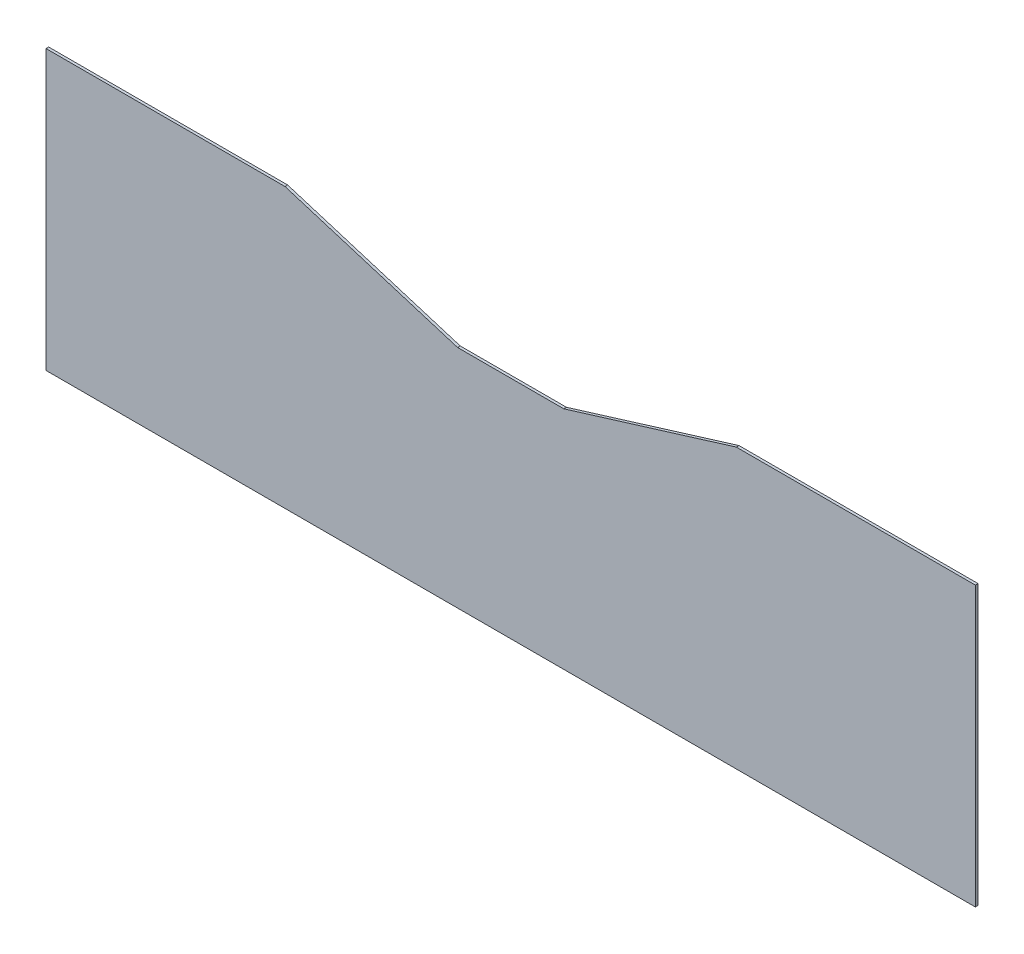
ISO-10303-21;
HEADER;
FILE_DESCRIPTION(('STEP AP214'),'2;1');
FILE_NAME('part.step','',(''),(''),'','','');
FILE_SCHEMA(('AUTOMOTIVE_DESIGN { 1 0 10303 214 1 1 1 1 }'));
ENDSEC;
DATA;
#1=APPLICATION_CONTEXT('core data for automotive mechanical design processes');
#2=APPLICATION_PROTOCOL_DEFINITION('international standard','automotive_design',2000,#1);
#3=PRODUCT_CONTEXT('',#1,'mechanical');
#4=PRODUCT('Part','Part','',(#3));
#5=PRODUCT_RELATED_PRODUCT_CATEGORY('part','',(#4));
#6=PRODUCT_DEFINITION_FORMATION('','',#4);
#7=PRODUCT_DEFINITION_CONTEXT('part definition',#1,'design');
#8=PRODUCT_DEFINITION('design','',#6,#7);
#9=PRODUCT_DEFINITION_SHAPE('','',#8);
#10=(LENGTH_UNIT() NAMED_UNIT(*) SI_UNIT(.MILLI.,.METRE.));
#11=(NAMED_UNIT(*) PLANE_ANGLE_UNIT() SI_UNIT($,.RADIAN.));
#12=(NAMED_UNIT(*) SI_UNIT($,.STERADIAN.) SOLID_ANGLE_UNIT());
#13=UNCERTAINTY_MEASURE_WITH_UNIT(LENGTH_MEASURE(1.E-05),#10,'distance_accuracy_value','');
#14=(GEOMETRIC_REPRESENTATION_CONTEXT(3) GLOBAL_UNCERTAINTY_ASSIGNED_CONTEXT((#13)) GLOBAL_UNIT_ASSIGNED_CONTEXT((#10,
#11,#12)) REPRESENTATION_CONTEXT('',''));
#15=CARTESIAN_POINT('',(0.,0.,0.));
#16=DIRECTION('',(0.,0.,1.));
#17=DIRECTION('',(1.,0.,0.));
#18=AXIS2_PLACEMENT_3D('',#15,#16,#17);
#19=CARTESIAN_POINT('',(0.,210.,2.));
#20=DIRECTION('',(1.,0.,0.));
#21=DIRECTION('',(0.,1.,0.));
#22=AXIS2_PLACEMENT_3D('',#19,#20,#21);
#23=PLANE('',#22);
#24=DIRECTION('',(0.,-1.,0.));
#25=VECTOR('',#24,1.);
#26=CARTESIAN_POINT('',(0.,210.,0.));
#27=LINE('',#26,#25);
#28=CARTESIAN_POINT('',(0.,210.,0.));
#29=VERTEX_POINT('',#28);
#30=CARTESIAN_POINT('',(0.,0.,0.));
#31=VERTEX_POINT('',#30);
#32=EDGE_CURVE('E130',#29,#31,#27,.T.);
#33=ORIENTED_EDGE('',*,*,#32,.T.);
#34=DIRECTION('',(0.,0.,-1.));
#35=VECTOR('',#34,1.);
#36=CARTESIAN_POINT('',(0.,0.,2.));
#37=LINE('',#36,#35);
#38=CARTESIAN_POINT('',(0.,0.,2.));
#39=VERTEX_POINT('',#38);
#40=EDGE_CURVE('E11',#39,#31,#37,.T.);
#41=ORIENTED_EDGE('',*,*,#40,.F.);
#42=DIRECTION('',(0.,-1.,0.));
#43=VECTOR('',#42,1.);
#44=CARTESIAN_POINT('',(0.,210.,2.));
#45=LINE('',#44,#43);
#46=CARTESIAN_POINT('',(0.,210.,2.));
#47=VERTEX_POINT('',#46);
#48=EDGE_CURVE('E144',#47,#39,#45,.T.);
#49=ORIENTED_EDGE('',*,*,#48,.F.);
#50=DIRECTION('',(0.,0.,-1.));
#51=VECTOR('',#50,1.);
#52=CARTESIAN_POINT('',(0.,210.,2.));
#53=LINE('',#52,#51);
#54=EDGE_CURVE('E126',#47,#29,#53,.T.);
#55=ORIENTED_EDGE('',*,*,#54,.T.);
#56=EDGE_LOOP('',(#33,#41,#49,#55));
#57=FACE_BOUND('',#56,.T.);
#58=ADVANCED_FACE('F34',(#57),#23,.F.);
#59=CARTESIAN_POINT('',(0.,0.,2.));
#60=DIRECTION('',(0.,1.,0.));
#61=DIRECTION('',(-1.,0.,0.));
#62=AXIS2_PLACEMENT_3D('',#59,#60,#61);
#63=PLANE('',#62);
#64=DIRECTION('',(1.,0.,0.));
#65=VECTOR('',#64,1.);
#66=CARTESIAN_POINT('',(0.,0.,0.));
#67=LINE('',#66,#65);
#68=CARTESIAN_POINT('',(700.,0.,0.));
#69=VERTEX_POINT('',#68);
#70=EDGE_CURVE('E133',#31,#69,#67,.T.);
#71=ORIENTED_EDGE('',*,*,#70,.T.);
#72=DIRECTION('',(0.,0.,-1.));
#73=VECTOR('',#72,1.);
#74=CARTESIAN_POINT('',(700.,0.,2.));
#75=LINE('',#74,#73);
#76=CARTESIAN_POINT('',(700.,0.,2.));
#77=VERTEX_POINT('',#76);
#78=EDGE_CURVE('E42',#77,#69,#75,.T.);
#79=ORIENTED_EDGE('',*,*,#78,.F.);
#80=DIRECTION('',(1.,0.,0.));
#81=VECTOR('',#80,1.);
#82=CARTESIAN_POINT('',(0.,0.,2.));
#83=LINE('',#82,#81);
#84=EDGE_CURVE('E93',#39,#77,#83,.T.);
#85=ORIENTED_EDGE('',*,*,#84,.F.);
#86=ORIENTED_EDGE('',*,*,#40,.T.);
#87=EDGE_LOOP('',(#71,#79,#85,#86));
#88=FACE_BOUND('',#87,.T.);
#89=ADVANCED_FACE('F179',(#88),#63,.F.);
#90=CARTESIAN_POINT('',(700.,0.,2.));
#91=DIRECTION('',(-1.,0.,0.));
#92=DIRECTION('',(0.,0.,1.));
#93=AXIS2_PLACEMENT_3D('',#90,#91,#92);
#94=PLANE('',#93);
#95=DIRECTION('',(0.,1.,0.));
#96=VECTOR('',#95,1.);
#97=CARTESIAN_POINT('',(700.,0.,0.));
#98=LINE('',#97,#96);
#99=CARTESIAN_POINT('',(700.,210.,0.));
#100=VERTEX_POINT('',#99);
#101=EDGE_CURVE('E135',#69,#100,#98,.T.);
#102=ORIENTED_EDGE('',*,*,#101,.T.);
#103=DIRECTION('',(0.,0.,-1.));
#104=VECTOR('',#103,1.);
#105=CARTESIAN_POINT('',(700.,210.,2.));
#106=LINE('',#105,#104);
#107=CARTESIAN_POINT('',(700.,210.,2.));
#108=VERTEX_POINT('',#107);
#109=EDGE_CURVE('E151',#108,#100,#106,.T.);
#110=ORIENTED_EDGE('',*,*,#109,.F.);
#111=DIRECTION('',(0.,1.,0.));
#112=VECTOR('',#111,1.);
#113=CARTESIAN_POINT('',(700.,0.,2.));
#114=LINE('',#113,#112);
#115=EDGE_CURVE('E159',#77,#108,#114,.T.);
#116=ORIENTED_EDGE('',*,*,#115,.F.);
#117=ORIENTED_EDGE('',*,*,#78,.T.);
#118=EDGE_LOOP('',(#102,#110,#116,#117));
#119=FACE_BOUND('',#118,.T.);
#120=ADVANCED_FACE('F157',(#119),#94,.F.);
#121=CARTESIAN_POINT('',(700.,210.,2.));
#122=DIRECTION('',(0.,-1.,0.));
#123=DIRECTION('',(1.,0.,0.));
#124=AXIS2_PLACEMENT_3D('',#121,#122,#123);
#125=PLANE('',#124);
#126=DIRECTION('',(-1.,0.,0.));
#127=VECTOR('',#126,1.);
#128=CARTESIAN_POINT('',(700.,210.,0.));
#129=LINE('',#128,#127);
#130=CARTESIAN_POINT('',(520.,210.,0.));
#131=VERTEX_POINT('',#130);
#132=EDGE_CURVE('E137',#100,#131,#129,.T.);
#133=ORIENTED_EDGE('',*,*,#132,.T.);
#134=DIRECTION('',(0.,0.,-1.));
#135=VECTOR('',#134,1.);
#136=CARTESIAN_POINT('',(520.,210.,2.));
#137=LINE('',#136,#135);
#138=CARTESIAN_POINT('',(520.,210.,2.));
#139=VERTEX_POINT('',#138);
#140=EDGE_CURVE('E148',#139,#131,#137,.T.);
#141=ORIENTED_EDGE('',*,*,#140,.F.);
#142=DIRECTION('',(-1.,0.,0.));
#143=VECTOR('',#142,1.);
#144=CARTESIAN_POINT('',(700.,210.,2.));
#145=LINE('',#144,#143);
#146=EDGE_CURVE('E171',#108,#139,#145,.T.);
#147=ORIENTED_EDGE('',*,*,#146,.F.);
#148=ORIENTED_EDGE('',*,*,#109,.T.);
#149=EDGE_LOOP('',(#133,#141,#147,#148));
#150=FACE_BOUND('',#149,.T.);
#151=ADVANCED_FACE('F167',(#150),#125,.F.);
#152=CARTESIAN_POINT('',(520.,210.,2.));
#153=DIRECTION('',(0.294085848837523,-0.95577900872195,0.));
#154=DIRECTION('',(0.95577900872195,0.294085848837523,0.));
#155=AXIS2_PLACEMENT_3D('',#152,#153,#154);
#156=PLANE('',#155);
#157=DIRECTION('',(-0.95577900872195,-0.294085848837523,0.));
#158=VECTOR('',#157,1.);
#159=CARTESIAN_POINT('',(520.,210.,0.));
#160=LINE('',#159,#158);
#161=CARTESIAN_POINT('',(390.,170.,0.));
#162=VERTEX_POINT('',#161);
#163=EDGE_CURVE('E139',#131,#162,#160,.T.);
#164=ORIENTED_EDGE('',*,*,#163,.T.);
#165=DIRECTION('',(0.,0.,-1.));
#166=VECTOR('',#165,1.);
#167=CARTESIAN_POINT('',(390.,170.,2.));
#168=LINE('',#167,#166);
#169=CARTESIAN_POINT('',(390.,170.,2.));
#170=VERTEX_POINT('',#169);
#171=EDGE_CURVE('E121',#170,#162,#168,.T.);
#172=ORIENTED_EDGE('',*,*,#171,.F.);
#173=DIRECTION('',(-0.95577900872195,-0.294085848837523,0.));
#174=VECTOR('',#173,1.);
#175=CARTESIAN_POINT('',(520.,210.,2.));
#176=LINE('',#175,#174);
#177=EDGE_CURVE('E112',#139,#170,#176,.T.);
#178=ORIENTED_EDGE('',*,*,#177,.F.);
#179=ORIENTED_EDGE('',*,*,#140,.T.);
#180=EDGE_LOOP('',(#164,#172,#178,#179));
#181=FACE_BOUND('',#180,.T.);
#182=ADVANCED_FACE('F170',(#181),#156,.F.);
#183=CARTESIAN_POINT('',(390.,170.,2.));
#184=DIRECTION('',(0.,-1.,0.));
#185=DIRECTION('',(0.,0.,-1.));
#186=AXIS2_PLACEMENT_3D('',#183,#184,#185);
#187=PLANE('',#186);
#188=DIRECTION('',(-1.,0.,0.));
#189=VECTOR('',#188,1.);
#190=CARTESIAN_POINT('',(390.,170.,0.));
#191=LINE('',#190,#189);
#192=CARTESIAN_POINT('',(310.,170.,0.));
#193=VERTEX_POINT('',#192);
#194=EDGE_CURVE('E120',#162,#193,#191,.T.);
#195=ORIENTED_EDGE('',*,*,#194,.T.);
#196=DIRECTION('',(0.,0.,-1.));
#197=VECTOR('',#196,1.);
#198=CARTESIAN_POINT('',(310.,170.,2.));
#199=LINE('',#198,#197);
#200=CARTESIAN_POINT('',(310.,170.,2.));
#201=VERTEX_POINT('',#200);
#202=EDGE_CURVE('E117',#201,#193,#199,.T.);
#203=ORIENTED_EDGE('',*,*,#202,.F.);
#204=DIRECTION('',(-1.,0.,0.));
#205=VECTOR('',#204,1.);
#206=CARTESIAN_POINT('',(390.,170.,2.));
#207=LINE('',#206,#205);
#208=EDGE_CURVE('E106',#170,#201,#207,.T.);
#209=ORIENTED_EDGE('',*,*,#208,.F.);
#210=ORIENTED_EDGE('',*,*,#171,.T.);
#211=EDGE_LOOP('',(#195,#203,#209,#210));
#212=FACE_BOUND('',#211,.T.);
#213=ADVANCED_FACE('F118',(#212),#187,.F.);
#214=CARTESIAN_POINT('',(310.,170.,2.));
#215=DIRECTION('',(-0.294085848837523,-0.95577900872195,0.));
#216=DIRECTION('',(0.95577900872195,-0.294085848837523,0.));
#217=AXIS2_PLACEMENT_3D('',#214,#215,#216);
#218=PLANE('',#217);
#219=DIRECTION('',(-0.95577900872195,0.294085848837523,0.));
#220=VECTOR('',#219,1.);
#221=CARTESIAN_POINT('',(310.,170.,0.));
#222=LINE('',#221,#220);
#223=CARTESIAN_POINT('',(180.,210.,0.));
#224=VERTEX_POINT('',#223);
#225=EDGE_CURVE('E79',#193,#224,#222,.T.);
#226=ORIENTED_EDGE('',*,*,#225,.T.);
#227=DIRECTION('',(0.,0.,-1.));
#228=VECTOR('',#227,1.);
#229=CARTESIAN_POINT('',(180.,210.,2.));
#230=LINE('',#229,#228);
#231=CARTESIAN_POINT('',(180.,210.,2.));
#232=VERTEX_POINT('',#231);
#233=EDGE_CURVE('E122',#232,#224,#230,.T.);
#234=ORIENTED_EDGE('',*,*,#233,.F.);
#235=DIRECTION('',(-0.95577900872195,0.294085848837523,0.));
#236=VECTOR('',#235,1.);
#237=CARTESIAN_POINT('',(310.,170.,2.));
#238=LINE('',#237,#236);
#239=EDGE_CURVE('E110',#201,#232,#238,.T.);
#240=ORIENTED_EDGE('',*,*,#239,.F.);
#241=ORIENTED_EDGE('',*,*,#202,.T.);
#242=EDGE_LOOP('',(#226,#234,#240,#241));
#243=FACE_BOUND('',#242,.T.);
#244=ADVANCED_FACE('F124',(#243),#218,.F.);
#245=CARTESIAN_POINT('',(180.,210.,2.));
#246=DIRECTION('',(0.,-1.,0.));
#247=DIRECTION('',(1.,0.,0.));
#248=AXIS2_PLACEMENT_3D('',#245,#246,#247);
#249=PLANE('',#248);
#250=DIRECTION('',(-1.,0.,0.));
#251=VECTOR('',#250,1.);
#252=CARTESIAN_POINT('',(180.,210.,0.));
#253=LINE('',#252,#251);
#254=EDGE_CURVE('E85',#224,#29,#253,.T.);
#255=ORIENTED_EDGE('',*,*,#254,.T.);
#256=ORIENTED_EDGE('',*,*,#54,.F.);
#257=DIRECTION('',(-1.,0.,0.));
#258=VECTOR('',#257,1.);
#259=CARTESIAN_POINT('',(180.,210.,2.));
#260=LINE('',#259,#258);
#261=EDGE_CURVE('E50',#232,#47,#260,.T.);
#262=ORIENTED_EDGE('',*,*,#261,.F.);
#263=ORIENTED_EDGE('',*,*,#233,.T.);
#264=EDGE_LOOP('',(#255,#256,#262,#263));
#265=FACE_BOUND('',#264,.T.);
#266=ADVANCED_FACE('F195',(#265),#249,.F.);
#267=CARTESIAN_POINT('',(0.,0.,2.));
#268=DIRECTION('',(0.,0.,1.));
#269=DIRECTION('',(1.,0.,0.));
#270=AXIS2_PLACEMENT_3D('',#267,#268,#269);
#271=PLANE('',#270);
#272=ORIENTED_EDGE('',*,*,#48,.T.);
#273=ORIENTED_EDGE('',*,*,#84,.T.);
#274=ORIENTED_EDGE('',*,*,#115,.T.);
#275=ORIENTED_EDGE('',*,*,#146,.T.);
#276=ORIENTED_EDGE('',*,*,#177,.T.);
#277=ORIENTED_EDGE('',*,*,#208,.T.);
#278=ORIENTED_EDGE('',*,*,#239,.T.);
#279=ORIENTED_EDGE('',*,*,#261,.T.);
#280=EDGE_LOOP('',(#272,#273,#274,#275,#276,#277,#278,#279));
#281=FACE_BOUND('',#280,.T.);
#282=ADVANCED_FACE('F108',(#281),#271,.T.);
#283=CARTESIAN_POINT('',(0.,0.,0.));
#284=DIRECTION('',(0.,0.,1.));
#285=DIRECTION('',(1.,0.,0.));
#286=AXIS2_PLACEMENT_3D('',#283,#284,#285);
#287=PLANE('',#286);
#288=ORIENTED_EDGE('',*,*,#32,.F.);
#289=ORIENTED_EDGE('',*,*,#254,.F.);
#290=ORIENTED_EDGE('',*,*,#225,.F.);
#291=ORIENTED_EDGE('',*,*,#194,.F.);
#292=ORIENTED_EDGE('',*,*,#163,.F.);
#293=ORIENTED_EDGE('',*,*,#132,.F.);
#294=ORIENTED_EDGE('',*,*,#101,.F.);
#295=ORIENTED_EDGE('',*,*,#70,.F.);
#296=EDGE_LOOP('',(#288,#289,#290,#291,#292,#293,#294,#295));
#297=FACE_BOUND('',#296,.T.);
#298=ADVANCED_FACE('F163',(#297),#287,.F.);
#299=CLOSED_SHELL('',(#58,#89,#120,#151,#182,#213,#244,#266,#282,#298));
#300=MANIFOLD_SOLID_BREP('B2',#299);
#301=ADVANCED_BREP_SHAPE_REPRESENTATION('',(#18,#300),#14);
#302=SHAPE_DEFINITION_REPRESENTATION(#9,#301);
ENDSEC;
END-ISO-10303-21;
